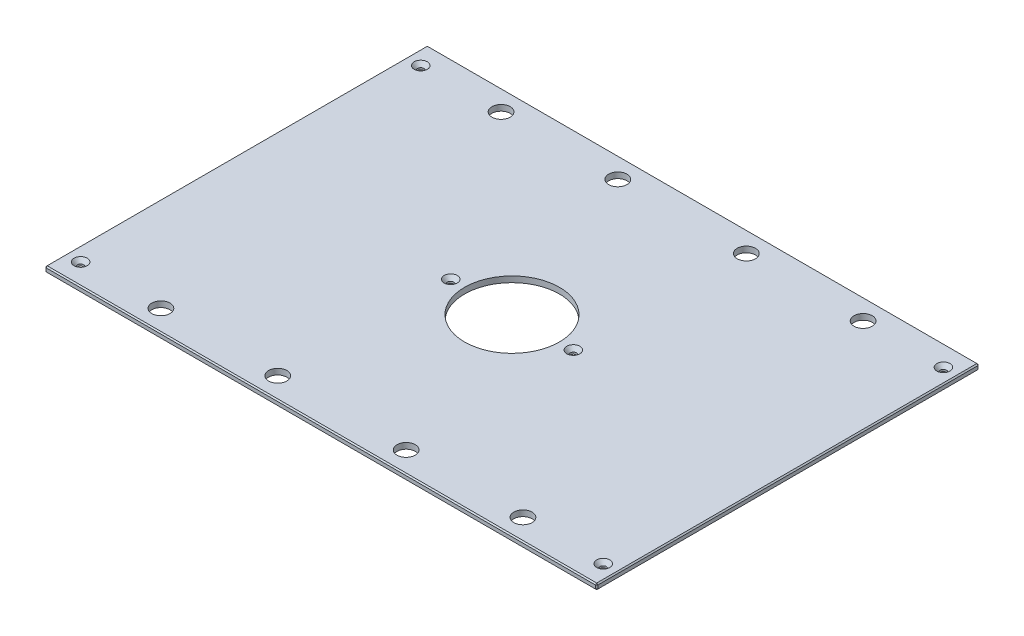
ISO-10303-21;
HEADER;
FILE_DESCRIPTION(('STEP AP214'),'2;1');
FILE_NAME('part.step','',(''),(''),'','','');
FILE_SCHEMA(('AUTOMOTIVE_DESIGN { 1 0 10303 214 1 1 1 1 }'));
ENDSEC;
DATA;
#1=APPLICATION_CONTEXT('core data for automotive mechanical design processes');
#2=APPLICATION_PROTOCOL_DEFINITION('international standard','automotive_design',2000,#1);
#3=PRODUCT_CONTEXT('',#1,'mechanical');
#4=PRODUCT('Part','Part','',(#3));
#5=PRODUCT_RELATED_PRODUCT_CATEGORY('part','',(#4));
#6=PRODUCT_DEFINITION_FORMATION('','',#4);
#7=PRODUCT_DEFINITION_CONTEXT('part definition',#1,'design');
#8=PRODUCT_DEFINITION('design','',#6,#7);
#9=PRODUCT_DEFINITION_SHAPE('','',#8);
#10=(LENGTH_UNIT() NAMED_UNIT(*) SI_UNIT(.MILLI.,.METRE.));
#11=(NAMED_UNIT(*) PLANE_ANGLE_UNIT() SI_UNIT($,.RADIAN.));
#12=(NAMED_UNIT(*) SI_UNIT($,.STERADIAN.) SOLID_ANGLE_UNIT());
#13=UNCERTAINTY_MEASURE_WITH_UNIT(LENGTH_MEASURE(1.E-05),#10,'distance_accuracy_value','');
#14=(GEOMETRIC_REPRESENTATION_CONTEXT(3) GLOBAL_UNCERTAINTY_ASSIGNED_CONTEXT((#13)) GLOBAL_UNIT_ASSIGNED_CONTEXT((#10,
#11,#12)) REPRESENTATION_CONTEXT('',''));
#15=CARTESIAN_POINT('',(0.,0.,0.));
#16=DIRECTION('',(0.,0.,1.));
#17=DIRECTION('',(1.,0.,0.));
#18=AXIS2_PLACEMENT_3D('',#15,#16,#17);
#19=CARTESIAN_POINT('',(-300.0375,6.35,-207.9625));
#20=DIRECTION('',(1.,0.,0.));
#21=DIRECTION('',(0.,0.,-1.));
#22=AXIS2_PLACEMENT_3D('',#19,#20,#21);
#23=PLANE('',#22);
#24=DIRECTION('',(0.,0.,-1.));
#25=VECTOR('',#24,1.);
#26=CARTESIAN_POINT('',(-300.0375,5.08000000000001,-207.9625));
#27=LINE('',#26,#25);
#28=CARTESIAN_POINT('',(-300.0375,5.08000000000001,206.6925));
#29=VERTEX_POINT('',#28);
#30=CARTESIAN_POINT('',(-300.0375,5.08000000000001,-206.6925));
#31=VERTEX_POINT('',#30);
#32=EDGE_CURVE('E142',#29,#31,#27,.T.);
#33=ORIENTED_EDGE('',*,*,#32,.T.);
#34=DIRECTION('',(0.,-1.,0.));
#35=VECTOR('',#34,1.);
#36=CARTESIAN_POINT('',(-300.0375,6.35,-206.6925));
#37=LINE('',#36,#35);
#38=CARTESIAN_POINT('',(-300.0375,1.26999999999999,-206.6925));
#39=VERTEX_POINT('',#38);
#40=EDGE_CURVE('E137',#31,#39,#37,.T.);
#41=ORIENTED_EDGE('',*,*,#40,.T.);
#42=DIRECTION('',(0.,0.,1.));
#43=VECTOR('',#42,1.);
#44=CARTESIAN_POINT('',(-300.0375,1.26999999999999,-207.9625));
#45=LINE('',#44,#43);
#46=CARTESIAN_POINT('',(-300.0375,1.26999999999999,206.6925));
#47=VERTEX_POINT('',#46);
#48=EDGE_CURVE('E132',#39,#47,#45,.T.);
#49=ORIENTED_EDGE('',*,*,#48,.T.);
#50=DIRECTION('',(0.,1.,0.));
#51=VECTOR('',#50,1.);
#52=CARTESIAN_POINT('',(-300.0375,6.35,206.6925));
#53=LINE('',#52,#51);
#54=EDGE_CURVE('E134',#47,#29,#53,.T.);
#55=ORIENTED_EDGE('',*,*,#54,.T.);
#56=EDGE_LOOP('',(#33,#41,#49,#55));
#57=FACE_BOUND('',#56,.T.);
#58=ADVANCED_FACE('F40',(#57),#23,.F.);
#59=CARTESIAN_POINT('',(-300.0375,6.35,207.9625));
#60=DIRECTION('',(0.,0.,-1.));
#61=DIRECTION('',(-1.,0.,0.));
#62=AXIS2_PLACEMENT_3D('',#59,#60,#61);
#63=PLANE('',#62);
#64=DIRECTION('',(1.,0.,0.));
#65=VECTOR('',#64,1.);
#66=CARTESIAN_POINT('',(-300.0375,1.26999999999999,207.9625));
#67=LINE('',#66,#65);
#68=CARTESIAN_POINT('',(-298.7675,1.26999999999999,207.9625));
#69=VERTEX_POINT('',#68);
#70=CARTESIAN_POINT('',(298.7675,1.26999999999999,207.9625));
#71=VERTEX_POINT('',#70);
#72=EDGE_CURVE('E64',#69,#71,#67,.T.);
#73=ORIENTED_EDGE('',*,*,#72,.T.);
#74=DIRECTION('',(0.,1.,0.));
#75=VECTOR('',#74,1.);
#76=CARTESIAN_POINT('',(298.7675,6.35,207.9625));
#77=LINE('',#76,#75);
#78=CARTESIAN_POINT('',(298.7675,5.08000000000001,207.9625));
#79=VERTEX_POINT('',#78);
#80=EDGE_CURVE('E11',#71,#79,#77,.T.);
#81=ORIENTED_EDGE('',*,*,#80,.T.);
#82=DIRECTION('',(-1.,0.,0.));
#83=VECTOR('',#82,1.);
#84=CARTESIAN_POINT('',(-300.0375,5.08000000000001,207.9625));
#85=LINE('',#84,#83);
#86=CARTESIAN_POINT('',(-298.7675,5.08000000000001,207.9625));
#87=VERTEX_POINT('',#86);
#88=EDGE_CURVE('E50',#79,#87,#85,.T.);
#89=ORIENTED_EDGE('',*,*,#88,.T.);
#90=DIRECTION('',(0.,-1.,0.));
#91=VECTOR('',#90,1.);
#92=CARTESIAN_POINT('',(-298.7675,6.35,207.9625));
#93=LINE('',#92,#91);
#94=EDGE_CURVE('E368',#87,#69,#93,.T.);
#95=ORIENTED_EDGE('',*,*,#94,.T.);
#96=EDGE_LOOP('',(#73,#81,#89,#95));
#97=FACE_BOUND('',#96,.T.);
#98=ADVANCED_FACE('F446',(#97),#63,.F.);
#99=CARTESIAN_POINT('',(300.0375,6.35,-207.9625));
#100=DIRECTION('',(-1.,0.,0.));
#101=DIRECTION('',(0.,0.,1.));
#102=AXIS2_PLACEMENT_3D('',#99,#100,#101);
#103=PLANE('',#102);
#104=DIRECTION('',(0.,0.,-1.));
#105=VECTOR('',#104,1.);
#106=CARTESIAN_POINT('',(300.0375,1.26999999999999,-207.9625));
#107=LINE('',#106,#105);
#108=CARTESIAN_POINT('',(300.0375,1.26999999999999,206.6925));
#109=VERTEX_POINT('',#108);
#110=CARTESIAN_POINT('',(300.0375,1.26999999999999,-206.6925));
#111=VERTEX_POINT('',#110);
#112=EDGE_CURVE('E361',#109,#111,#107,.T.);
#113=ORIENTED_EDGE('',*,*,#112,.T.);
#114=DIRECTION('',(0.,1.,0.));
#115=VECTOR('',#114,1.);
#116=CARTESIAN_POINT('',(300.0375,6.35,-206.6925));
#117=LINE('',#116,#115);
#118=CARTESIAN_POINT('',(300.0375,5.08000000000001,-206.6925));
#119=VERTEX_POINT('',#118);
#120=EDGE_CURVE('E364',#111,#119,#117,.T.);
#121=ORIENTED_EDGE('',*,*,#120,.T.);
#122=DIRECTION('',(0.,0.,1.));
#123=VECTOR('',#122,1.);
#124=CARTESIAN_POINT('',(300.0375,5.08000000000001,207.9625));
#125=LINE('',#124,#123);
#126=CARTESIAN_POINT('',(300.0375,5.08000000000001,206.6925));
#127=VERTEX_POINT('',#126);
#128=EDGE_CURVE('E358',#119,#127,#125,.T.);
#129=ORIENTED_EDGE('',*,*,#128,.T.);
#130=DIRECTION('',(0.,-1.,0.));
#131=VECTOR('',#130,1.);
#132=CARTESIAN_POINT('',(300.0375,6.35,206.6925));
#133=LINE('',#132,#131);
#134=EDGE_CURVE('E355',#127,#109,#133,.T.);
#135=ORIENTED_EDGE('',*,*,#134,.T.);
#136=EDGE_LOOP('',(#113,#121,#129,#135));
#137=FACE_BOUND('',#136,.T.);
#138=ADVANCED_FACE('F433',(#137),#103,.F.);
#139=CARTESIAN_POINT('',(-300.0375,6.35,-207.9625));
#140=DIRECTION('',(0.,0.,1.));
#141=DIRECTION('',(1.,0.,0.));
#142=AXIS2_PLACEMENT_3D('',#139,#140,#141);
#143=PLANE('',#142);
#144=DIRECTION('',(-1.,0.,0.));
#145=VECTOR('',#144,1.);
#146=CARTESIAN_POINT('',(-300.0375,1.26999999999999,-207.9625));
#147=LINE('',#146,#145);
#148=CARTESIAN_POINT('',(298.7675,1.26999999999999,-207.9625));
#149=VERTEX_POINT('',#148);
#150=CARTESIAN_POINT('',(-298.7675,1.26999999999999,-207.9625));
#151=VERTEX_POINT('',#150);
#152=EDGE_CURVE('E320',#149,#151,#147,.T.);
#153=ORIENTED_EDGE('',*,*,#152,.T.);
#154=DIRECTION('',(0.,1.,0.));
#155=VECTOR('',#154,1.);
#156=CARTESIAN_POINT('',(-298.7675,6.35,-207.9625));
#157=LINE('',#156,#155);
#158=CARTESIAN_POINT('',(-298.7675,5.08000000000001,-207.9625));
#159=VERTEX_POINT('',#158);
#160=EDGE_CURVE('E326',#151,#159,#157,.T.);
#161=ORIENTED_EDGE('',*,*,#160,.T.);
#162=DIRECTION('',(1.,0.,0.));
#163=VECTOR('',#162,1.);
#164=CARTESIAN_POINT('',(300.0375,5.08000000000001,-207.9625));
#165=LINE('',#164,#163);
#166=CARTESIAN_POINT('',(298.7675,5.08000000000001,-207.9625));
#167=VERTEX_POINT('',#166);
#168=EDGE_CURVE('E323',#159,#167,#165,.T.);
#169=ORIENTED_EDGE('',*,*,#168,.T.);
#170=DIRECTION('',(0.,-1.,0.));
#171=VECTOR('',#170,1.);
#172=CARTESIAN_POINT('',(298.7675,6.35,-207.9625));
#173=LINE('',#172,#171);
#174=EDGE_CURVE('E317',#167,#149,#173,.T.);
#175=ORIENTED_EDGE('',*,*,#174,.T.);
#176=EDGE_LOOP('',(#153,#161,#169,#175));
#177=FACE_BOUND('',#176,.T.);
#178=ADVANCED_FACE('F407',(#177),#143,.F.);
#179=CARTESIAN_POINT('',(0.,6.35,0.));
#180=DIRECTION('',(0.,1.,0.));
#181=DIRECTION('',(0.,0.,1.));
#182=AXIS2_PLACEMENT_3D('',#179,#180,#181);
#183=PLANE('',#182);
#184=CARTESIAN_POINT('',(284.1625,6.35,-184.94248));
#185=DIRECTION('',(0.,1.,0.));
#186=DIRECTION('',(0.,0.,1.));
#187=AXIS2_PLACEMENT_3D('',#184,#185,#186);
#188=CIRCLE('',#187,7.13740000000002);
#189=CARTESIAN_POINT('',(284.1625,6.35,-177.80508));
#190=VERTEX_POINT('',#189);
#191=EDGE_CURVE('E978',#190,#190,#188,.T.);
#192=ORIENTED_EDGE('',*,*,#191,.F.);
#193=EDGE_LOOP('',(#192));
#194=FACE_BOUND('',#193,.T.);
#195=CARTESIAN_POINT('',(284.1625,6.35,184.94248));
#196=DIRECTION('',(0.,1.,0.));
#197=DIRECTION('',(0.,0.,1.));
#198=AXIS2_PLACEMENT_3D('',#195,#196,#197);
#199=CIRCLE('',#198,7.13740000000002);
#200=CARTESIAN_POINT('',(284.1625,6.35,192.07988));
#201=VERTEX_POINT('',#200);
#202=EDGE_CURVE('E982',#201,#201,#199,.T.);
#203=ORIENTED_EDGE('',*,*,#202,.F.);
#204=EDGE_LOOP('',(#203));
#205=FACE_BOUND('',#204,.T.);
#206=CARTESIAN_POINT('',(-284.1625,6.35,184.94248));
#207=DIRECTION('',(0.,1.,0.));
#208=DIRECTION('',(0.,0.,1.));
#209=AXIS2_PLACEMENT_3D('',#206,#207,#208);
#210=CIRCLE('',#209,7.13740000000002);
#211=CARTESIAN_POINT('',(-284.1625,6.35,192.07988));
#212=VERTEX_POINT('',#211);
#213=EDGE_CURVE('E986',#212,#212,#210,.T.);
#214=ORIENTED_EDGE('',*,*,#213,.F.);
#215=EDGE_LOOP('',(#214));
#216=FACE_BOUND('',#215,.T.);
#217=CARTESIAN_POINT('',(-66.675,6.35,0.));
#218=DIRECTION('',(0.,1.,0.));
#219=DIRECTION('',(0.,0.,1.));
#220=AXIS2_PLACEMENT_3D('',#217,#218,#219);
#221=CIRCLE('',#220,7.1374);
#222=CARTESIAN_POINT('',(-66.675,6.35,7.1374));
#223=VERTEX_POINT('',#222);
#224=EDGE_CURVE('E990',#223,#223,#221,.T.);
#225=ORIENTED_EDGE('',*,*,#224,.F.);
#226=EDGE_LOOP('',(#225));
#227=FACE_BOUND('',#226,.T.);
#228=CARTESIAN_POINT('',(66.675,6.35,0.));
#229=DIRECTION('',(0.,1.,0.));
#230=DIRECTION('',(0.,0.,1.));
#231=AXIS2_PLACEMENT_3D('',#228,#229,#230);
#232=CIRCLE('',#231,7.1374);
#233=CARTESIAN_POINT('',(66.675,6.35,7.1374));
#234=VERTEX_POINT('',#233);
#235=EDGE_CURVE('E994',#234,#234,#232,.T.);
#236=ORIENTED_EDGE('',*,*,#235,.F.);
#237=EDGE_LOOP('',(#236));
#238=FACE_BOUND('',#237,.T.);
#239=CARTESIAN_POINT('',(-284.1625,6.35,-184.94248));
#240=DIRECTION('',(0.,1.,0.));
#241=DIRECTION('',(0.,0.,1.));
#242=AXIS2_PLACEMENT_3D('',#239,#240,#241);
#243=CIRCLE('',#242,7.13740000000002);
#244=CARTESIAN_POINT('',(-284.1625,6.35,-177.80508));
#245=VERTEX_POINT('',#244);
#246=EDGE_CURVE('E997',#245,#245,#243,.T.);
#247=ORIENTED_EDGE('',*,*,#246,.F.);
#248=EDGE_LOOP('',(#247));
#249=FACE_BOUND('',#248,.T.);
#250=DIRECTION('',(0.,0.,-1.));
#251=VECTOR('',#250,1.);
#252=CARTESIAN_POINT('',(298.7675,6.35,-207.9625));
#253=LINE('',#252,#251);
#254=CARTESIAN_POINT('',(298.7675,6.35,206.6925));
#255=VERTEX_POINT('',#254);
#256=CARTESIAN_POINT('',(298.7675,6.35,-206.6925));
#257=VERTEX_POINT('',#256);
#258=EDGE_CURVE('E336',#255,#257,#253,.T.);
#259=ORIENTED_EDGE('',*,*,#258,.T.);
#260=DIRECTION('',(-1.,0.,0.));
#261=VECTOR('',#260,1.);
#262=CARTESIAN_POINT('',(-300.0375,6.35,-206.6925));
#263=LINE('',#262,#261);
#264=CARTESIAN_POINT('',(-298.7675,6.35,-206.6925));
#265=VERTEX_POINT('',#264);
#266=EDGE_CURVE('E339',#257,#265,#263,.T.);
#267=ORIENTED_EDGE('',*,*,#266,.T.);
#268=DIRECTION('',(0.,0.,1.));
#269=VECTOR('',#268,1.);
#270=CARTESIAN_POINT('',(-298.7675,6.35,207.9625));
#271=LINE('',#270,#269);
#272=CARTESIAN_POINT('',(-298.7675,6.35,206.6925));
#273=VERTEX_POINT('',#272);
#274=EDGE_CURVE('E333',#265,#273,#271,.T.);
#275=ORIENTED_EDGE('',*,*,#274,.T.);
#276=DIRECTION('',(1.,0.,0.));
#277=VECTOR('',#276,1.);
#278=CARTESIAN_POINT('',(300.0375,6.35,206.6925));
#279=LINE('',#278,#277);
#280=EDGE_CURVE('E330',#273,#255,#279,.T.);
#281=ORIENTED_EDGE('',*,*,#280,.T.);
#282=EDGE_LOOP('',(#259,#267,#275,#281));
#283=FACE_BOUND('',#282,.T.);
#284=CARTESIAN_POINT('',(196.85,6.35,-184.94248));
#285=DIRECTION('',(0.,1.,0.));
#286=DIRECTION('',(0.,0.,1.));
#287=AXIS2_PLACEMENT_3D('',#284,#285,#286);
#288=CIRCLE('',#287,9.921875);
#289=CARTESIAN_POINT('',(196.85,6.35,-175.020605));
#290=VERTEX_POINT('',#289);
#291=EDGE_CURVE('E232',#290,#290,#288,.T.);
#292=ORIENTED_EDGE('',*,*,#291,.F.);
#293=EDGE_LOOP('',(#292));
#294=FACE_BOUND('',#293,.T.);
#295=CARTESIAN_POINT('',(-196.85,6.35,-184.94248));
#296=DIRECTION('',(0.,1.,0.));
#297=DIRECTION('',(0.,0.,1.));
#298=AXIS2_PLACEMENT_3D('',#295,#296,#297);
#299=CIRCLE('',#298,9.921875);
#300=CARTESIAN_POINT('',(-196.85,6.35,-175.020605));
#301=VERTEX_POINT('',#300);
#302=EDGE_CURVE('E247',#301,#301,#299,.T.);
#303=ORIENTED_EDGE('',*,*,#302,.F.);
#304=EDGE_LOOP('',(#303));
#305=FACE_BOUND('',#304,.T.);
#306=CARTESIAN_POINT('',(196.85,6.35,184.94248));
#307=DIRECTION('',(0.,1.,0.));
#308=DIRECTION('',(0.,0.,1.));
#309=AXIS2_PLACEMENT_3D('',#306,#307,#308);
#310=CIRCLE('',#309,9.921875);
#311=CARTESIAN_POINT('',(196.85,6.35,194.864355));
#312=VERTEX_POINT('',#311);
#313=EDGE_CURVE('E259',#312,#312,#310,.T.);
#314=ORIENTED_EDGE('',*,*,#313,.F.);
#315=EDGE_LOOP('',(#314));
#316=FACE_BOUND('',#315,.T.);
#317=CARTESIAN_POINT('',(-196.85,6.35,184.94248));
#318=DIRECTION('',(0.,1.,0.));
#319=DIRECTION('',(0.,0.,1.));
#320=AXIS2_PLACEMENT_3D('',#317,#318,#319);
#321=CIRCLE('',#320,9.921875);
#322=CARTESIAN_POINT('',(-196.85,6.35,194.864355));
#323=VERTEX_POINT('',#322);
#324=EDGE_CURVE('E266',#323,#323,#321,.T.);
#325=ORIENTED_EDGE('',*,*,#324,.F.);
#326=EDGE_LOOP('',(#325));
#327=FACE_BOUND('',#326,.T.);
#328=CARTESIAN_POINT('',(-69.85,6.35,-184.94248));
#329=DIRECTION('',(0.,1.,0.));
#330=DIRECTION('',(0.,0.,1.));
#331=AXIS2_PLACEMENT_3D('',#328,#329,#330);
#332=CIRCLE('',#331,9.921875);
#333=CARTESIAN_POINT('',(-69.85,6.35,-175.020605));
#334=VERTEX_POINT('',#333);
#335=EDGE_CURVE('E274',#334,#334,#332,.T.);
#336=ORIENTED_EDGE('',*,*,#335,.F.);
#337=EDGE_LOOP('',(#336));
#338=FACE_BOUND('',#337,.T.);
#339=CARTESIAN_POINT('',(69.85,6.35,-184.94248));
#340=DIRECTION('',(0.,1.,0.));
#341=DIRECTION('',(0.,0.,1.));
#342=AXIS2_PLACEMENT_3D('',#339,#340,#341);
#343=CIRCLE('',#342,9.921875);
#344=CARTESIAN_POINT('',(69.85,6.35,-175.020605));
#345=VERTEX_POINT('',#344);
#346=EDGE_CURVE('E282',#345,#345,#343,.T.);
#347=ORIENTED_EDGE('',*,*,#346,.F.);
#348=EDGE_LOOP('',(#347));
#349=FACE_BOUND('',#348,.T.);
#350=CARTESIAN_POINT('',(69.85,6.35,184.94248));
#351=DIRECTION('',(0.,1.,0.));
#352=DIRECTION('',(0.,0.,1.));
#353=AXIS2_PLACEMENT_3D('',#350,#351,#352);
#354=CIRCLE('',#353,9.921875);
#355=CARTESIAN_POINT('',(69.85,6.35,194.864355));
#356=VERTEX_POINT('',#355);
#357=EDGE_CURVE('E290',#356,#356,#354,.T.);
#358=ORIENTED_EDGE('',*,*,#357,.F.);
#359=EDGE_LOOP('',(#358));
#360=FACE_BOUND('',#359,.T.);
#361=CARTESIAN_POINT('',(-69.85,6.35,184.94248));
#362=DIRECTION('',(0.,1.,0.));
#363=DIRECTION('',(0.,0.,1.));
#364=AXIS2_PLACEMENT_3D('',#361,#362,#363);
#365=CIRCLE('',#364,9.921875);
#366=CARTESIAN_POINT('',(-69.85,6.35,194.864355));
#367=VERTEX_POINT('',#366);
#368=EDGE_CURVE('E298',#367,#367,#365,.T.);
#369=ORIENTED_EDGE('',*,*,#368,.F.);
#370=EDGE_LOOP('',(#369));
#371=FACE_BOUND('',#370,.T.);
#372=CARTESIAN_POINT('',(0.,6.35,0.));
#373=DIRECTION('',(0.,1.,0.));
#374=DIRECTION('',(0.,0.,1.));
#375=AXIS2_PLACEMENT_3D('',#372,#373,#374);
#376=CIRCLE('',#375,51.562);
#377=CARTESIAN_POINT('',(0.,6.35,51.562));
#378=VERTEX_POINT('',#377);
#379=EDGE_CURVE('E306',#378,#378,#376,.T.);
#380=ORIENTED_EDGE('',*,*,#379,.F.);
#381=EDGE_LOOP('',(#380));
#382=FACE_BOUND('',#381,.T.);
#383=ADVANCED_FACE('F455',(#194,#205,#216,#227,#238,#249,#283,#294,#305,#316,#327,#338,#349,
#360,#371,#382),#183,.T.);
#384=CARTESIAN_POINT('',(0.,0.,0.));
#385=DIRECTION('',(0.,1.,0.));
#386=DIRECTION('',(0.,0.,1.));
#387=AXIS2_PLACEMENT_3D('',#384,#385,#386);
#388=PLANE('',#387);
#389=CARTESIAN_POINT('',(284.1625,0.,-184.94248));
#390=DIRECTION('',(0.,1.,0.));
#391=DIRECTION('',(0.,0.,1.));
#392=AXIS2_PLACEMENT_3D('',#389,#390,#391);
#393=CIRCLE('',#392,3.3782);
#394=CARTESIAN_POINT('',(284.1625,0.,-181.56428));
#395=VERTEX_POINT('',#394);
#396=EDGE_CURVE('E1043',#395,#395,#393,.T.);
#397=ORIENTED_EDGE('',*,*,#396,.T.);
#398=EDGE_LOOP('',(#397));
#399=FACE_BOUND('',#398,.T.);
#400=CARTESIAN_POINT('',(284.1625,0.,184.94248));
#401=DIRECTION('',(0.,1.,0.));
#402=DIRECTION('',(0.,0.,1.));
#403=AXIS2_PLACEMENT_3D('',#400,#401,#402);
#404=CIRCLE('',#403,3.3782);
#405=CARTESIAN_POINT('',(284.1625,0.,188.32068));
#406=VERTEX_POINT('',#405);
#407=EDGE_CURVE('E1033',#406,#406,#404,.T.);
#408=ORIENTED_EDGE('',*,*,#407,.T.);
#409=EDGE_LOOP('',(#408));
#410=FACE_BOUND('',#409,.T.);
#411=CARTESIAN_POINT('',(-284.1625,0.,184.94248));
#412=DIRECTION('',(0.,1.,0.));
#413=DIRECTION('',(0.,0.,1.));
#414=AXIS2_PLACEMENT_3D('',#411,#412,#413);
#415=CIRCLE('',#414,3.3782);
#416=CARTESIAN_POINT('',(-284.1625,0.,188.32068));
#417=VERTEX_POINT('',#416);
#418=EDGE_CURVE('E1025',#417,#417,#415,.T.);
#419=ORIENTED_EDGE('',*,*,#418,.T.);
#420=EDGE_LOOP('',(#419));
#421=FACE_BOUND('',#420,.T.);
#422=CARTESIAN_POINT('',(-66.675,0.,0.));
#423=DIRECTION('',(0.,1.,0.));
#424=DIRECTION('',(0.,0.,1.));
#425=AXIS2_PLACEMENT_3D('',#422,#423,#424);
#426=CIRCLE('',#425,3.3782);
#427=CARTESIAN_POINT('',(-66.675,0.,3.3782));
#428=VERTEX_POINT('',#427);
#429=EDGE_CURVE('E1015',#428,#428,#426,.T.);
#430=ORIENTED_EDGE('',*,*,#429,.T.);
#431=EDGE_LOOP('',(#430));
#432=FACE_BOUND('',#431,.T.);
#433=CARTESIAN_POINT('',(66.675,0.,0.));
#434=DIRECTION('',(0.,1.,0.));
#435=DIRECTION('',(0.,0.,1.));
#436=AXIS2_PLACEMENT_3D('',#433,#434,#435);
#437=CIRCLE('',#436,3.3782);
#438=CARTESIAN_POINT('',(66.675,0.,3.3782));
#439=VERTEX_POINT('',#438);
#440=EDGE_CURVE('E1001',#439,#439,#437,.T.);
#441=ORIENTED_EDGE('',*,*,#440,.T.);
#442=EDGE_LOOP('',(#441));
#443=FACE_BOUND('',#442,.T.);
#444=CARTESIAN_POINT('',(-284.1625,0.,-184.94248));
#445=DIRECTION('',(0.,1.,0.));
#446=DIRECTION('',(0.,0.,1.));
#447=AXIS2_PLACEMENT_3D('',#444,#445,#446);
#448=CIRCLE('',#447,3.3782);
#449=CARTESIAN_POINT('',(-284.1625,0.,-181.56428));
#450=VERTEX_POINT('',#449);
#451=EDGE_CURVE('E250',#450,#450,#448,.T.);
#452=ORIENTED_EDGE('',*,*,#451,.T.);
#453=EDGE_LOOP('',(#452));
#454=FACE_BOUND('',#453,.T.);
#455=DIRECTION('',(0.,0.,-1.));
#456=VECTOR('',#455,1.);
#457=CARTESIAN_POINT('',(-298.7675,0.,0.));
#458=LINE('',#457,#456);
#459=CARTESIAN_POINT('',(-298.7675,0.,206.6925));
#460=VERTEX_POINT('',#459);
#461=CARTESIAN_POINT('',(-298.7675,0.,-206.6925));
#462=VERTEX_POINT('',#461);
#463=EDGE_CURVE('E167',#460,#462,#458,.T.);
#464=ORIENTED_EDGE('',*,*,#463,.T.);
#465=DIRECTION('',(1.,0.,0.));
#466=VECTOR('',#465,1.);
#467=CARTESIAN_POINT('',(0.,0.,-206.6925));
#468=LINE('',#467,#466);
#469=CARTESIAN_POINT('',(298.7675,0.,-206.6925));
#470=VERTEX_POINT('',#469);
#471=EDGE_CURVE('E351',#462,#470,#468,.T.);
#472=ORIENTED_EDGE('',*,*,#471,.T.);
#473=DIRECTION('',(0.,0.,1.));
#474=VECTOR('',#473,1.);
#475=CARTESIAN_POINT('',(298.7675,0.,0.));
#476=LINE('',#475,#474);
#477=CARTESIAN_POINT('',(298.7675,0.,206.6925));
#478=VERTEX_POINT('',#477);
#479=EDGE_CURVE('E348',#470,#478,#476,.T.);
#480=ORIENTED_EDGE('',*,*,#479,.T.);
#481=DIRECTION('',(-1.,0.,0.));
#482=VECTOR('',#481,1.);
#483=CARTESIAN_POINT('',(0.,0.,206.6925));
#484=LINE('',#483,#482);
#485=EDGE_CURVE('E343',#478,#460,#484,.T.);
#486=ORIENTED_EDGE('',*,*,#485,.T.);
#487=EDGE_LOOP('',(#464,#472,#480,#486));
#488=FACE_BOUND('',#487,.T.);
#489=CARTESIAN_POINT('',(196.85,0.,-184.94248));
#490=DIRECTION('',(0.,1.,0.));
#491=DIRECTION('',(0.,0.,1.));
#492=AXIS2_PLACEMENT_3D('',#489,#490,#491);
#493=CIRCLE('',#492,9.921875);
#494=CARTESIAN_POINT('',(196.85,0.,-175.020605));
#495=VERTEX_POINT('',#494);
#496=EDGE_CURVE('E240',#495,#495,#493,.T.);
#497=ORIENTED_EDGE('',*,*,#496,.T.);
#498=EDGE_LOOP('',(#497));
#499=FACE_BOUND('',#498,.T.);
#500=CARTESIAN_POINT('',(-196.85,0.,-184.94248));
#501=DIRECTION('',(0.,1.,0.));
#502=DIRECTION('',(0.,0.,1.));
#503=AXIS2_PLACEMENT_3D('',#500,#501,#502);
#504=CIRCLE('',#503,9.921875);
#505=CARTESIAN_POINT('',(-196.85,0.,-175.020605));
#506=VERTEX_POINT('',#505);
#507=EDGE_CURVE('E255',#506,#506,#504,.T.);
#508=ORIENTED_EDGE('',*,*,#507,.T.);
#509=EDGE_LOOP('',(#508));
#510=FACE_BOUND('',#509,.T.);
#511=CARTESIAN_POINT('',(196.85,0.,184.94248));
#512=DIRECTION('',(0.,1.,0.));
#513=DIRECTION('',(0.,0.,1.));
#514=AXIS2_PLACEMENT_3D('',#511,#512,#513);
#515=CIRCLE('',#514,9.921875);
#516=CARTESIAN_POINT('',(196.85,0.,194.864355));
#517=VERTEX_POINT('',#516);
#518=EDGE_CURVE('E263',#517,#517,#515,.T.);
#519=ORIENTED_EDGE('',*,*,#518,.T.);
#520=EDGE_LOOP('',(#519));
#521=FACE_BOUND('',#520,.T.);
#522=CARTESIAN_POINT('',(-196.85,0.,184.94248));
#523=DIRECTION('',(0.,1.,0.));
#524=DIRECTION('',(0.,0.,1.));
#525=AXIS2_PLACEMENT_3D('',#522,#523,#524);
#526=CIRCLE('',#525,9.921875);
#527=CARTESIAN_POINT('',(-196.85,0.,194.864355));
#528=VERTEX_POINT('',#527);
#529=EDGE_CURVE('E270',#528,#528,#526,.T.);
#530=ORIENTED_EDGE('',*,*,#529,.T.);
#531=EDGE_LOOP('',(#530));
#532=FACE_BOUND('',#531,.T.);
#533=CARTESIAN_POINT('',(-69.85,0.,-184.94248));
#534=DIRECTION('',(0.,1.,0.));
#535=DIRECTION('',(0.,0.,1.));
#536=AXIS2_PLACEMENT_3D('',#533,#534,#535);
#537=CIRCLE('',#536,9.921875);
#538=CARTESIAN_POINT('',(-69.85,0.,-175.020605));
#539=VERTEX_POINT('',#538);
#540=EDGE_CURVE('E278',#539,#539,#537,.T.);
#541=ORIENTED_EDGE('',*,*,#540,.T.);
#542=EDGE_LOOP('',(#541));
#543=FACE_BOUND('',#542,.T.);
#544=CARTESIAN_POINT('',(69.85,0.,-184.94248));
#545=DIRECTION('',(0.,1.,0.));
#546=DIRECTION('',(0.,0.,1.));
#547=AXIS2_PLACEMENT_3D('',#544,#545,#546);
#548=CIRCLE('',#547,9.921875);
#549=CARTESIAN_POINT('',(69.85,0.,-175.020605));
#550=VERTEX_POINT('',#549);
#551=EDGE_CURVE('E286',#550,#550,#548,.T.);
#552=ORIENTED_EDGE('',*,*,#551,.T.);
#553=EDGE_LOOP('',(#552));
#554=FACE_BOUND('',#553,.T.);
#555=CARTESIAN_POINT('',(69.85,0.,184.94248));
#556=DIRECTION('',(0.,1.,0.));
#557=DIRECTION('',(0.,0.,1.));
#558=AXIS2_PLACEMENT_3D('',#555,#556,#557);
#559=CIRCLE('',#558,9.921875);
#560=CARTESIAN_POINT('',(69.85,0.,194.864355));
#561=VERTEX_POINT('',#560);
#562=EDGE_CURVE('E294',#561,#561,#559,.T.);
#563=ORIENTED_EDGE('',*,*,#562,.T.);
#564=EDGE_LOOP('',(#563));
#565=FACE_BOUND('',#564,.T.);
#566=CARTESIAN_POINT('',(-69.85,0.,184.94248));
#567=DIRECTION('',(0.,1.,0.));
#568=DIRECTION('',(0.,0.,1.));
#569=AXIS2_PLACEMENT_3D('',#566,#567,#568);
#570=CIRCLE('',#569,9.921875);
#571=CARTESIAN_POINT('',(-69.85,0.,194.864355));
#572=VERTEX_POINT('',#571);
#573=EDGE_CURVE('E302',#572,#572,#570,.T.);
#574=ORIENTED_EDGE('',*,*,#573,.T.);
#575=EDGE_LOOP('',(#574));
#576=FACE_BOUND('',#575,.T.);
#577=CARTESIAN_POINT('',(0.,0.,0.));
#578=DIRECTION('',(0.,1.,0.));
#579=DIRECTION('',(0.,0.,1.));
#580=AXIS2_PLACEMENT_3D('',#577,#578,#579);
#581=CIRCLE('',#580,51.562);
#582=CARTESIAN_POINT('',(0.,0.,51.562));
#583=VERTEX_POINT('',#582);
#584=EDGE_CURVE('E155',#583,#583,#581,.T.);
#585=ORIENTED_EDGE('',*,*,#584,.T.);
#586=EDGE_LOOP('',(#585));
#587=FACE_BOUND('',#586,.T.);
#588=ADVANCED_FACE('F420',(#399,#410,#421,#432,#443,#454,#488,#499,#510,#521,#532,#543,#554,
#565,#576,#587),#388,.F.);
#589=CARTESIAN_POINT('',(0.,0.,0.));
#590=DIRECTION('',(0.,1.,0.));
#591=DIRECTION('',(0.,0.,1.));
#592=AXIS2_PLACEMENT_3D('',#589,#590,#591);
#593=CYLINDRICAL_SURFACE('',#592,51.562);
#594=ORIENTED_EDGE('',*,*,#584,.F.);
#595=EDGE_LOOP('',(#594));
#596=FACE_BOUND('',#595,.T.);
#597=ORIENTED_EDGE('',*,*,#379,.T.);
#598=EDGE_LOOP('',(#597));
#599=FACE_BOUND('',#598,.T.);
#600=ADVANCED_FACE('F701',(#596,#599),#593,.F.);
#601=CARTESIAN_POINT('',(-69.85,6.35,184.94248));
#602=DIRECTION('',(0.,1.,0.));
#603=DIRECTION('',(0.,0.,1.));
#604=AXIS2_PLACEMENT_3D('',#601,#602,#603);
#605=CYLINDRICAL_SURFACE('',#604,9.921875);
#606=ORIENTED_EDGE('',*,*,#573,.F.);
#607=EDGE_LOOP('',(#606));
#608=FACE_BOUND('',#607,.T.);
#609=ORIENTED_EDGE('',*,*,#368,.T.);
#610=EDGE_LOOP('',(#609));
#611=FACE_BOUND('',#610,.T.);
#612=ADVANCED_FACE('F895',(#608,#611),#605,.F.);
#613=CARTESIAN_POINT('',(69.85,6.35,184.94248));
#614=DIRECTION('',(0.,1.,0.));
#615=DIRECTION('',(0.,0.,1.));
#616=AXIS2_PLACEMENT_3D('',#613,#614,#615);
#617=CYLINDRICAL_SURFACE('',#616,9.921875);
#618=ORIENTED_EDGE('',*,*,#562,.F.);
#619=EDGE_LOOP('',(#618));
#620=FACE_BOUND('',#619,.T.);
#621=ORIENTED_EDGE('',*,*,#357,.T.);
#622=EDGE_LOOP('',(#621));
#623=FACE_BOUND('',#622,.T.);
#624=ADVANCED_FACE('F885',(#620,#623),#617,.F.);
#625=CARTESIAN_POINT('',(69.85,6.35,-184.94248));
#626=DIRECTION('',(0.,1.,0.));
#627=DIRECTION('',(0.,0.,1.));
#628=AXIS2_PLACEMENT_3D('',#625,#626,#627);
#629=CYLINDRICAL_SURFACE('',#628,9.921875);
#630=ORIENTED_EDGE('',*,*,#551,.F.);
#631=EDGE_LOOP('',(#630));
#632=FACE_BOUND('',#631,.T.);
#633=ORIENTED_EDGE('',*,*,#346,.T.);
#634=EDGE_LOOP('',(#633));
#635=FACE_BOUND('',#634,.T.);
#636=ADVANCED_FACE('F875',(#632,#635),#629,.F.);
#637=CARTESIAN_POINT('',(-69.85,6.35,-184.94248));
#638=DIRECTION('',(0.,1.,0.));
#639=DIRECTION('',(0.,0.,1.));
#640=AXIS2_PLACEMENT_3D('',#637,#638,#639);
#641=CYLINDRICAL_SURFACE('',#640,9.921875);
#642=ORIENTED_EDGE('',*,*,#540,.F.);
#643=EDGE_LOOP('',(#642));
#644=FACE_BOUND('',#643,.T.);
#645=ORIENTED_EDGE('',*,*,#335,.T.);
#646=EDGE_LOOP('',(#645));
#647=FACE_BOUND('',#646,.T.);
#648=ADVANCED_FACE('F865',(#644,#647),#641,.F.);
#649=CARTESIAN_POINT('',(-196.85,6.35,184.94248));
#650=DIRECTION('',(0.,1.,0.));
#651=DIRECTION('',(0.,0.,1.));
#652=AXIS2_PLACEMENT_3D('',#649,#650,#651);
#653=CYLINDRICAL_SURFACE('',#652,9.921875);
#654=ORIENTED_EDGE('',*,*,#529,.F.);
#655=EDGE_LOOP('',(#654));
#656=FACE_BOUND('',#655,.T.);
#657=ORIENTED_EDGE('',*,*,#324,.T.);
#658=EDGE_LOOP('',(#657));
#659=FACE_BOUND('',#658,.T.);
#660=ADVANCED_FACE('F855',(#656,#659),#653,.F.);
#661=CARTESIAN_POINT('',(196.85,6.35,184.94248));
#662=DIRECTION('',(0.,1.,0.));
#663=DIRECTION('',(0.,0.,1.));
#664=AXIS2_PLACEMENT_3D('',#661,#662,#663);
#665=CYLINDRICAL_SURFACE('',#664,9.921875);
#666=ORIENTED_EDGE('',*,*,#518,.F.);
#667=EDGE_LOOP('',(#666));
#668=FACE_BOUND('',#667,.T.);
#669=ORIENTED_EDGE('',*,*,#313,.T.);
#670=EDGE_LOOP('',(#669));
#671=FACE_BOUND('',#670,.T.);
#672=ADVANCED_FACE('F845',(#668,#671),#665,.F.);
#673=CARTESIAN_POINT('',(-196.85,6.35,-184.94248));
#674=DIRECTION('',(0.,1.,0.));
#675=DIRECTION('',(0.,0.,1.));
#676=AXIS2_PLACEMENT_3D('',#673,#674,#675);
#677=CYLINDRICAL_SURFACE('',#676,9.921875);
#678=ORIENTED_EDGE('',*,*,#507,.F.);
#679=EDGE_LOOP('',(#678));
#680=FACE_BOUND('',#679,.T.);
#681=ORIENTED_EDGE('',*,*,#302,.T.);
#682=EDGE_LOOP('',(#681));
#683=FACE_BOUND('',#682,.T.);
#684=ADVANCED_FACE('F835',(#680,#683),#677,.F.);
#685=CARTESIAN_POINT('',(196.85,6.35,-184.94248));
#686=DIRECTION('',(0.,1.,0.));
#687=DIRECTION('',(0.,0.,1.));
#688=AXIS2_PLACEMENT_3D('',#685,#686,#687);
#689=CYLINDRICAL_SURFACE('',#688,9.921875);
#690=ORIENTED_EDGE('',*,*,#496,.F.);
#691=EDGE_LOOP('',(#690));
#692=FACE_BOUND('',#691,.T.);
#693=ORIENTED_EDGE('',*,*,#291,.T.);
#694=EDGE_LOOP('',(#693));
#695=FACE_BOUND('',#694,.T.);
#696=ADVANCED_FACE('F464',(#692,#695),#689,.F.);
#697=CARTESIAN_POINT('',(300.0375,6.35,206.6925));
#698=DIRECTION('',(-0.707106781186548,0.,-0.707106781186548));
#699=DIRECTION('',(0.,-1.,0.));
#700=AXIS2_PLACEMENT_3D('',#697,#698,#699);
#701=PLANE('',#700);
#702=DIRECTION('',(-0.707106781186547,0.,0.707106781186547));
#703=VECTOR('',#702,1.);
#704=CARTESIAN_POINT('',(300.0375,5.08000000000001,206.6925));
#705=LINE('',#704,#703);
#706=EDGE_CURVE('E44',#79,#127,#705,.F.);
#707=ORIENTED_EDGE('',*,*,#706,.F.);
#708=ORIENTED_EDGE('',*,*,#80,.F.);
#709=DIRECTION('',(0.707106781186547,0.,-0.707106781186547));
#710=VECTOR('',#709,1.);
#711=CARTESIAN_POINT('',(299.4025,1.26999999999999,207.3275));
#712=LINE('',#711,#710);
#713=EDGE_CURVE('E223',#109,#71,#712,.F.);
#714=ORIENTED_EDGE('',*,*,#713,.F.);
#715=ORIENTED_EDGE('',*,*,#134,.F.);
#716=EDGE_LOOP('',(#707,#708,#714,#715));
#717=FACE_BOUND('',#716,.T.);
#718=ADVANCED_FACE('F42',(#717),#701,.F.);
#719=CARTESIAN_POINT('',(300.0375,5.08000000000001,206.6925));
#720=DIRECTION('',(0.577350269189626,0.577350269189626,0.577350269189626));
#721=DIRECTION('',(0.707106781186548,0.,-0.707106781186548));
#722=AXIS2_PLACEMENT_3D('',#719,#720,#721);
#723=PLANE('',#722);
#724=DIRECTION('',(0.,-0.707106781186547,0.707106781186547));
#725=VECTOR('',#724,1.);
#726=CARTESIAN_POINT('',(298.7675,5.715,207.3275));
#727=LINE('',#726,#725);
#728=EDGE_CURVE('E217',#79,#255,#727,.F.);
#729=ORIENTED_EDGE('',*,*,#728,.F.);
#730=ORIENTED_EDGE('',*,*,#706,.T.);
#731=DIRECTION('',(-0.707106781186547,0.707106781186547,0.));
#732=VECTOR('',#731,1.);
#733=CARTESIAN_POINT('',(300.0375,5.08000000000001,206.6925));
#734=LINE('',#733,#732);
#735=EDGE_CURVE('E220',#255,#127,#734,.F.);
#736=ORIENTED_EDGE('',*,*,#735,.F.);
#737=EDGE_LOOP('',(#729,#730,#736));
#738=FACE_BOUND('',#737,.T.);
#739=ADVANCED_FACE('F457',(#738),#723,.T.);
#740=CARTESIAN_POINT('',(298.7675,0.,206.6925));
#741=DIRECTION('',(0.577350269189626,-0.577350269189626,0.577350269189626));
#742=DIRECTION('',(0.707106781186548,0.,-0.707106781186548));
#743=AXIS2_PLACEMENT_3D('',#740,#741,#742);
#744=PLANE('',#743);
#745=DIRECTION('',(-0.707106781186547,-0.707106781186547,0.));
#746=VECTOR('',#745,1.);
#747=CARTESIAN_POINT('',(298.7675,0.,206.6925));
#748=LINE('',#747,#746);
#749=EDGE_CURVE('E209',#109,#478,#748,.T.);
#750=ORIENTED_EDGE('',*,*,#749,.F.);
#751=ORIENTED_EDGE('',*,*,#713,.T.);
#752=DIRECTION('',(0.,0.707106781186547,0.707106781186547));
#753=VECTOR('',#752,1.);
#754=CARTESIAN_POINT('',(298.7675,0.,206.6925));
#755=LINE('',#754,#753);
#756=EDGE_CURVE('E213',#478,#71,#755,.T.);
#757=ORIENTED_EDGE('',*,*,#756,.F.);
#758=EDGE_LOOP('',(#750,#751,#757));
#759=FACE_BOUND('',#758,.T.);
#760=ADVANCED_FACE('F426',(#759),#744,.T.);
#761=CARTESIAN_POINT('',(298.7675,6.35,0.));
#762=DIRECTION('',(0.707106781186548,0.707106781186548,0.));
#763=DIRECTION('',(0.,0.,1.));
#764=AXIS2_PLACEMENT_3D('',#761,#762,#763);
#765=PLANE('',#764);
#766=ORIENTED_EDGE('',*,*,#735,.T.);
#767=ORIENTED_EDGE('',*,*,#128,.F.);
#768=DIRECTION('',(0.707106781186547,-0.707106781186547,0.));
#769=VECTOR('',#768,1.);
#770=CARTESIAN_POINT('',(299.4025,5.715,-206.6925));
#771=LINE('',#770,#769);
#772=EDGE_CURVE('E202',#257,#119,#771,.T.);
#773=ORIENTED_EDGE('',*,*,#772,.F.);
#774=ORIENTED_EDGE('',*,*,#258,.F.);
#775=EDGE_LOOP('',(#766,#767,#773,#774));
#776=FACE_BOUND('',#775,.T.);
#777=ADVANCED_FACE('F443',(#776),#765,.T.);
#778=CARTESIAN_POINT('',(0.,6.35,206.6925));
#779=DIRECTION('',(0.,0.707106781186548,0.707106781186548));
#780=DIRECTION('',(-1.,0.,0.));
#781=AXIS2_PLACEMENT_3D('',#778,#779,#780);
#782=PLANE('',#781);
#783=ORIENTED_EDGE('',*,*,#728,.T.);
#784=ORIENTED_EDGE('',*,*,#280,.F.);
#785=DIRECTION('',(0.,0.707106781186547,-0.707106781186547));
#786=VECTOR('',#785,1.);
#787=CARTESIAN_POINT('',(-298.7675,6.35,206.6925));
#788=LINE('',#787,#786);
#789=EDGE_CURVE('E198',#87,#273,#788,.T.);
#790=ORIENTED_EDGE('',*,*,#789,.F.);
#791=ORIENTED_EDGE('',*,*,#88,.F.);
#792=EDGE_LOOP('',(#783,#784,#790,#791));
#793=FACE_BOUND('',#792,.T.);
#794=ADVANCED_FACE('F448',(#793),#782,.T.);
#795=CARTESIAN_POINT('',(-298.7675,6.35,207.9625));
#796=DIRECTION('',(0.707106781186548,0.,-0.707106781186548));
#797=DIRECTION('',(0.,-1.,0.));
#798=AXIS2_PLACEMENT_3D('',#795,#796,#797);
#799=PLANE('',#798);
#800=DIRECTION('',(0.707106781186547,0.,0.707106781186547));
#801=VECTOR('',#800,1.);
#802=CARTESIAN_POINT('',(-300.0375,1.26999999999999,206.6925));
#803=LINE('',#802,#801);
#804=EDGE_CURVE('E149',#69,#47,#803,.F.);
#805=ORIENTED_EDGE('',*,*,#804,.F.);
#806=ORIENTED_EDGE('',*,*,#94,.F.);
#807=DIRECTION('',(-0.707106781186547,0.,-0.707106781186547));
#808=VECTOR('',#807,1.);
#809=CARTESIAN_POINT('',(-299.4025,5.08000000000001,207.3275));
#810=LINE('',#809,#808);
#811=EDGE_CURVE('E152',#29,#87,#810,.F.);
#812=ORIENTED_EDGE('',*,*,#811,.F.);
#813=ORIENTED_EDGE('',*,*,#54,.F.);
#814=EDGE_LOOP('',(#805,#806,#812,#813));
#815=FACE_BOUND('',#814,.T.);
#816=ADVANCED_FACE('F147',(#815),#799,.F.);
#817=CARTESIAN_POINT('',(-300.0375,1.26999999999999,207.9625));
#818=DIRECTION('',(0.,0.707106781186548,-0.707106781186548));
#819=DIRECTION('',(1.,0.,0.));
#820=AXIS2_PLACEMENT_3D('',#817,#818,#819);
#821=PLANE('',#820);
#822=ORIENTED_EDGE('',*,*,#756,.T.);
#823=ORIENTED_EDGE('',*,*,#72,.F.);
#824=DIRECTION('',(0.,-0.707106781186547,-0.707106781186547));
#825=VECTOR('',#824,1.);
#826=CARTESIAN_POINT('',(-298.7675,0.634999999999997,207.3275));
#827=LINE('',#826,#825);
#828=EDGE_CURVE('E163',#460,#69,#827,.F.);
#829=ORIENTED_EDGE('',*,*,#828,.F.);
#830=ORIENTED_EDGE('',*,*,#485,.F.);
#831=EDGE_LOOP('',(#822,#823,#829,#830));
#832=FACE_BOUND('',#831,.T.);
#833=ADVANCED_FACE('F425',(#832),#821,.F.);
#834=CARTESIAN_POINT('',(300.0375,1.26999999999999,-207.9625));
#835=DIRECTION('',(-0.707106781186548,0.707106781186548,0.));
#836=DIRECTION('',(0.,0.,-1.));
#837=AXIS2_PLACEMENT_3D('',#834,#835,#836);
#838=PLANE('',#837);
#839=ORIENTED_EDGE('',*,*,#749,.T.);
#840=ORIENTED_EDGE('',*,*,#479,.F.);
#841=DIRECTION('',(0.707106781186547,0.707106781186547,0.));
#842=VECTOR('',#841,1.);
#843=CARTESIAN_POINT('',(298.7675,0.,-206.6925));
#844=LINE('',#843,#842);
#845=EDGE_CURVE('E190',#111,#470,#844,.F.);
#846=ORIENTED_EDGE('',*,*,#845,.F.);
#847=ORIENTED_EDGE('',*,*,#112,.F.);
#848=EDGE_LOOP('',(#839,#840,#846,#847));
#849=FACE_BOUND('',#848,.T.);
#850=ADVANCED_FACE('F430',(#849),#838,.F.);
#851=CARTESIAN_POINT('',(298.7675,6.35,-207.9625));
#852=DIRECTION('',(-0.707106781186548,0.,0.707106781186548));
#853=DIRECTION('',(0.,-1.,0.));
#854=AXIS2_PLACEMENT_3D('',#851,#852,#853);
#855=PLANE('',#854);
#856=DIRECTION('',(0.707106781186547,0.,0.707106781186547));
#857=VECTOR('',#856,1.);
#858=CARTESIAN_POINT('',(298.7675,5.08000000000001,-207.9625));
#859=LINE('',#858,#857);
#860=EDGE_CURVE('E205',#119,#167,#859,.F.);
#861=ORIENTED_EDGE('',*,*,#860,.F.);
#862=ORIENTED_EDGE('',*,*,#120,.F.);
#863=DIRECTION('',(-0.707106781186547,0.,-0.707106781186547));
#864=VECTOR('',#863,1.);
#865=CARTESIAN_POINT('',(299.4025,1.26999999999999,-207.3275));
#866=LINE('',#865,#864);
#867=EDGE_CURVE('E186',#149,#111,#866,.F.);
#868=ORIENTED_EDGE('',*,*,#867,.F.);
#869=ORIENTED_EDGE('',*,*,#174,.F.);
#870=EDGE_LOOP('',(#861,#862,#868,#869));
#871=FACE_BOUND('',#870,.T.);
#872=ADVANCED_FACE('F438',(#871),#855,.F.);
#873=CARTESIAN_POINT('',(298.7675,5.08000000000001,-207.9625));
#874=DIRECTION('',(0.577350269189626,0.577350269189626,-0.577350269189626));
#875=DIRECTION('',(-0.707106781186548,0.,-0.707106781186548));
#876=AXIS2_PLACEMENT_3D('',#873,#874,#875);
#877=PLANE('',#876);
#878=ORIENTED_EDGE('',*,*,#772,.T.);
#879=ORIENTED_EDGE('',*,*,#860,.T.);
#880=DIRECTION('',(0.,0.707106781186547,0.707106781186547));
#881=VECTOR('',#880,1.);
#882=CARTESIAN_POINT('',(298.7675,5.08000000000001,-207.9625));
#883=LINE('',#882,#881);
#884=EDGE_CURVE('E176',#257,#167,#883,.F.);
#885=ORIENTED_EDGE('',*,*,#884,.F.);
#886=EDGE_LOOP('',(#878,#879,#885));
#887=FACE_BOUND('',#886,.T.);
#888=ADVANCED_FACE('F496',(#887),#877,.T.);
#889=CARTESIAN_POINT('',(-298.7675,6.35,206.6925));
#890=DIRECTION('',(-0.577350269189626,0.577350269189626,0.577350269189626));
#891=DIRECTION('',(0.707106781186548,0.,0.707106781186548));
#892=AXIS2_PLACEMENT_3D('',#889,#890,#891);
#893=PLANE('',#892);
#894=ORIENTED_EDGE('',*,*,#811,.T.);
#895=ORIENTED_EDGE('',*,*,#789,.T.);
#896=DIRECTION('',(-0.707106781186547,-0.707106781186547,0.));
#897=VECTOR('',#896,1.);
#898=CARTESIAN_POINT('',(-298.7675,6.35,206.6925));
#899=LINE('',#898,#897);
#900=EDGE_CURVE('E169',#29,#273,#899,.F.);
#901=ORIENTED_EDGE('',*,*,#900,.F.);
#902=EDGE_LOOP('',(#894,#895,#901));
#903=FACE_BOUND('',#902,.T.);
#904=ADVANCED_FACE('F450',(#903),#893,.T.);
#905=CARTESIAN_POINT('',(-300.0375,1.26999999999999,206.6925));
#906=DIRECTION('',(-0.577350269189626,-0.577350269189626,0.577350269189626));
#907=DIRECTION('',(0.707106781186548,0.,0.707106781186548));
#908=AXIS2_PLACEMENT_3D('',#905,#906,#907);
#909=PLANE('',#908);
#910=ORIENTED_EDGE('',*,*,#828,.T.);
#911=ORIENTED_EDGE('',*,*,#804,.T.);
#912=DIRECTION('',(-0.707106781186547,0.707106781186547,0.));
#913=VECTOR('',#912,1.);
#914=CARTESIAN_POINT('',(-300.0375,1.26999999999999,206.6925));
#915=LINE('',#914,#913);
#916=EDGE_CURVE('E160',#460,#47,#915,.T.);
#917=ORIENTED_EDGE('',*,*,#916,.F.);
#918=EDGE_LOOP('',(#910,#911,#917));
#919=FACE_BOUND('',#918,.T.);
#920=ADVANCED_FACE('F159',(#919),#909,.T.);
#921=CARTESIAN_POINT('',(298.7675,0.,-206.6925));
#922=DIRECTION('',(0.577350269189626,-0.577350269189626,-0.577350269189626));
#923=DIRECTION('',(-0.707106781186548,0.,-0.707106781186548));
#924=AXIS2_PLACEMENT_3D('',#921,#922,#923);
#925=PLANE('',#924);
#926=ORIENTED_EDGE('',*,*,#867,.T.);
#927=ORIENTED_EDGE('',*,*,#845,.T.);
#928=DIRECTION('',(0.,-0.707106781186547,0.707106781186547));
#929=VECTOR('',#928,1.);
#930=CARTESIAN_POINT('',(298.7675,0.,-206.6925));
#931=LINE('',#930,#929);
#932=EDGE_CURVE('E170',#149,#470,#931,.T.);
#933=ORIENTED_EDGE('',*,*,#932,.F.);
#934=EDGE_LOOP('',(#926,#927,#933));
#935=FACE_BOUND('',#934,.T.);
#936=ADVANCED_FACE('F488',(#935),#925,.T.);
#937=CARTESIAN_POINT('',(0.,6.35,-206.6925));
#938=DIRECTION('',(0.,0.707106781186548,-0.707106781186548));
#939=DIRECTION('',(1.,0.,0.));
#940=AXIS2_PLACEMENT_3D('',#937,#938,#939);
#941=PLANE('',#940);
#942=ORIENTED_EDGE('',*,*,#884,.T.);
#943=ORIENTED_EDGE('',*,*,#168,.F.);
#944=DIRECTION('',(0.,-0.707106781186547,-0.707106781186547));
#945=VECTOR('',#944,1.);
#946=CARTESIAN_POINT('',(-298.7675,5.08000000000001,-207.9625));
#947=LINE('',#946,#945);
#948=EDGE_CURVE('E179',#265,#159,#947,.T.);
#949=ORIENTED_EDGE('',*,*,#948,.F.);
#950=ORIENTED_EDGE('',*,*,#266,.F.);
#951=EDGE_LOOP('',(#942,#943,#949,#950));
#952=FACE_BOUND('',#951,.T.);
#953=ADVANCED_FACE('F402',(#952),#941,.T.);
#954=CARTESIAN_POINT('',(-298.7675,6.35,0.));
#955=DIRECTION('',(-0.707106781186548,0.707106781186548,0.));
#956=DIRECTION('',(0.,0.,-1.));
#957=AXIS2_PLACEMENT_3D('',#954,#955,#956);
#958=PLANE('',#957);
#959=ORIENTED_EDGE('',*,*,#900,.T.);
#960=ORIENTED_EDGE('',*,*,#274,.F.);
#961=DIRECTION('',(0.707106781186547,0.707106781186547,0.));
#962=VECTOR('',#961,1.);
#963=CARTESIAN_POINT('',(-299.4025,5.715,-206.6925));
#964=LINE('',#963,#962);
#965=EDGE_CURVE('E389',#31,#265,#964,.T.);
#966=ORIENTED_EDGE('',*,*,#965,.F.);
#967=ORIENTED_EDGE('',*,*,#32,.F.);
#968=EDGE_LOOP('',(#959,#960,#966,#967));
#969=FACE_BOUND('',#968,.T.);
#970=ADVANCED_FACE('F453',(#969),#958,.T.);
#971=CARTESIAN_POINT('',(-300.0375,1.26999999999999,-207.9625));
#972=DIRECTION('',(0.707106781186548,0.707106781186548,0.));
#973=DIRECTION('',(0.,0.,1.));
#974=AXIS2_PLACEMENT_3D('',#971,#972,#973);
#975=PLANE('',#974);
#976=ORIENTED_EDGE('',*,*,#916,.T.);
#977=ORIENTED_EDGE('',*,*,#48,.F.);
#978=DIRECTION('',(0.707106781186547,-0.707106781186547,0.));
#979=VECTOR('',#978,1.);
#980=CARTESIAN_POINT('',(-300.0375,1.26999999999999,-206.6925));
#981=LINE('',#980,#979);
#982=EDGE_CURVE('E385',#462,#39,#981,.F.);
#983=ORIENTED_EDGE('',*,*,#982,.F.);
#984=ORIENTED_EDGE('',*,*,#463,.F.);
#985=EDGE_LOOP('',(#976,#977,#983,#984));
#986=FACE_BOUND('',#985,.T.);
#987=ADVANCED_FACE('F166',(#986),#975,.F.);
#988=CARTESIAN_POINT('',(-300.0375,1.26999999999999,-207.9625));
#989=DIRECTION('',(0.,0.707106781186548,0.707106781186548));
#990=DIRECTION('',(-1.,0.,0.));
#991=AXIS2_PLACEMENT_3D('',#988,#989,#990);
#992=PLANE('',#991);
#993=ORIENTED_EDGE('',*,*,#932,.T.);
#994=ORIENTED_EDGE('',*,*,#471,.F.);
#995=DIRECTION('',(0.,0.707106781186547,-0.707106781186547));
#996=VECTOR('',#995,1.);
#997=CARTESIAN_POINT('',(-298.7675,0.634999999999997,-207.3275));
#998=LINE('',#997,#996);
#999=EDGE_CURVE('E381',#151,#462,#998,.F.);
#1000=ORIENTED_EDGE('',*,*,#999,.F.);
#1001=ORIENTED_EDGE('',*,*,#152,.F.);
#1002=EDGE_LOOP('',(#993,#994,#1000,#1001));
#1003=FACE_BOUND('',#1002,.T.);
#1004=ADVANCED_FACE('F417',(#1003),#992,.F.);
#1005=CARTESIAN_POINT('',(-298.7675,5.08000000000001,-207.9625));
#1006=DIRECTION('',(-0.577350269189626,0.577350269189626,-0.577350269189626));
#1007=DIRECTION('',(-0.707106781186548,0.,0.707106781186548));
#1008=AXIS2_PLACEMENT_3D('',#1005,#1006,#1007);
#1009=PLANE('',#1008);
#1010=ORIENTED_EDGE('',*,*,#965,.T.);
#1011=ORIENTED_EDGE('',*,*,#948,.T.);
#1012=DIRECTION('',(0.707106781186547,0.,-0.707106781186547));
#1013=VECTOR('',#1012,1.);
#1014=CARTESIAN_POINT('',(-298.7675,5.08000000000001,-207.9625));
#1015=LINE('',#1014,#1013);
#1016=EDGE_CURVE('E378',#31,#159,#1015,.T.);
#1017=ORIENTED_EDGE('',*,*,#1016,.F.);
#1018=EDGE_LOOP('',(#1010,#1011,#1017));
#1019=FACE_BOUND('',#1018,.T.);
#1020=ADVANCED_FACE('F397',(#1019),#1009,.T.);
#1021=CARTESIAN_POINT('',(-300.0375,1.26999999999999,-206.6925));
#1022=DIRECTION('',(-0.577350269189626,-0.577350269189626,-0.577350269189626));
#1023=DIRECTION('',(-0.707106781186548,0.,0.707106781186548));
#1024=AXIS2_PLACEMENT_3D('',#1021,#1022,#1023);
#1025=PLANE('',#1024);
#1026=ORIENTED_EDGE('',*,*,#999,.T.);
#1027=ORIENTED_EDGE('',*,*,#982,.T.);
#1028=DIRECTION('',(-0.707106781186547,0.,0.707106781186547));
#1029=VECTOR('',#1028,1.);
#1030=CARTESIAN_POINT('',(-300.0375,1.26999999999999,-206.6925));
#1031=LINE('',#1030,#1029);
#1032=EDGE_CURVE('E375',#151,#39,#1031,.T.);
#1033=ORIENTED_EDGE('',*,*,#1032,.F.);
#1034=EDGE_LOOP('',(#1026,#1027,#1033));
#1035=FACE_BOUND('',#1034,.T.);
#1036=ADVANCED_FACE('F414',(#1035),#1025,.T.);
#1037=CARTESIAN_POINT('',(-300.0375,6.35,-206.6925));
#1038=DIRECTION('',(0.707106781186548,0.,0.707106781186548));
#1039=DIRECTION('',(0.,-1.,0.));
#1040=AXIS2_PLACEMENT_3D('',#1037,#1038,#1039);
#1041=PLANE('',#1040);
#1042=ORIENTED_EDGE('',*,*,#1016,.T.);
#1043=ORIENTED_EDGE('',*,*,#160,.F.);
#1044=ORIENTED_EDGE('',*,*,#1032,.T.);
#1045=ORIENTED_EDGE('',*,*,#40,.F.);
#1046=EDGE_LOOP('',(#1042,#1043,#1044,#1045));
#1047=FACE_BOUND('',#1046,.T.);
#1048=ADVANCED_FACE('F412',(#1047),#1041,.F.);
#1049=CARTESIAN_POINT('',(-284.1625,6.35,-184.94248));
#1050=DIRECTION('',(0.,1.,0.));
#1051=DIRECTION('',(0.,0.,1.));
#1052=AXIS2_PLACEMENT_3D('',#1049,#1050,#1051);
#1053=CYLINDRICAL_SURFACE('',#1052,3.3782);
#1054=ORIENTED_EDGE('',*,*,#451,.F.);
#1055=EDGE_LOOP('',(#1054));
#1056=FACE_BOUND('',#1055,.T.);
#1057=CARTESIAN_POINT('',(-284.1625,2.02553508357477,-184.94248));
#1058=DIRECTION('',(0.,1.,0.));
#1059=DIRECTION('',(0.,0.,1.));
#1060=AXIS2_PLACEMENT_3D('',#1057,#1058,#1059);
#1061=CIRCLE('',#1060,3.3782);
#1062=CARTESIAN_POINT('',(-284.1625,2.02553508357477,-181.56428));
#1063=VERTEX_POINT('',#1062);
#1064=EDGE_CURVE('E1000',#1063,#1063,#1061,.T.);
#1065=ORIENTED_EDGE('',*,*,#1064,.T.);
#1066=EDGE_LOOP('',(#1065));
#1067=FACE_BOUND('',#1066,.T.);
#1068=ADVANCED_FACE('F475',(#1056,#1067),#1053,.F.);
#1069=CARTESIAN_POINT('',(-284.1625,6.35,-184.94248));
#1070=DIRECTION('',(0.,1.,0.));
#1071=DIRECTION('',(0.,0.,1.));
#1072=AXIS2_PLACEMENT_3D('',#1069,#1070,#1071);
#1073=CONICAL_SURFACE('',#1072,7.13740000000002,0.715584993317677);
#1074=ORIENTED_EDGE('',*,*,#1064,.F.);
#1075=EDGE_LOOP('',(#1074));
#1076=FACE_BOUND('',#1075,.T.);
#1077=ORIENTED_EDGE('',*,*,#246,.T.);
#1078=EDGE_LOOP('',(#1077));
#1079=FACE_BOUND('',#1078,.T.);
#1080=ADVANCED_FACE('F567',(#1076,#1079),#1073,.F.);
#1081=CARTESIAN_POINT('',(66.675,6.35,0.));
#1082=DIRECTION('',(0.,1.,0.));
#1083=DIRECTION('',(0.,0.,1.));
#1084=AXIS2_PLACEMENT_3D('',#1081,#1082,#1083);
#1085=CYLINDRICAL_SURFACE('',#1084,3.3782);
#1086=ORIENTED_EDGE('',*,*,#440,.F.);
#1087=EDGE_LOOP('',(#1086));
#1088=FACE_BOUND('',#1087,.T.);
#1089=CARTESIAN_POINT('',(66.675,2.02553508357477,0.));
#1090=DIRECTION('',(0.,1.,0.));
#1091=DIRECTION('',(0.,0.,1.));
#1092=AXIS2_PLACEMENT_3D('',#1089,#1090,#1091);
#1093=CIRCLE('',#1092,3.3782);
#1094=CARTESIAN_POINT('',(66.675,2.02553508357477,3.3782));
#1095=VERTEX_POINT('',#1094);
#1096=EDGE_CURVE('E1007',#1095,#1095,#1093,.T.);
#1097=ORIENTED_EDGE('',*,*,#1096,.T.);
#1098=EDGE_LOOP('',(#1097));
#1099=FACE_BOUND('',#1098,.T.);
#1100=ADVANCED_FACE('F574',(#1088,#1099),#1085,.F.);
#1101=CARTESIAN_POINT('',(66.675,6.35,0.));
#1102=DIRECTION('',(0.,1.,0.));
#1103=DIRECTION('',(0.,0.,1.));
#1104=AXIS2_PLACEMENT_3D('',#1101,#1102,#1103);
#1105=CONICAL_SURFACE('',#1104,7.1374,0.715584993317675);
#1106=ORIENTED_EDGE('',*,*,#1096,.F.);
#1107=EDGE_LOOP('',(#1106));
#1108=FACE_BOUND('',#1107,.T.);
#1109=ORIENTED_EDGE('',*,*,#235,.T.);
#1110=EDGE_LOOP('',(#1109));
#1111=FACE_BOUND('',#1110,.T.);
#1112=ADVANCED_FACE('F581',(#1108,#1111),#1105,.F.);
#1113=CARTESIAN_POINT('',(-66.675,6.35,0.));
#1114=DIRECTION('',(0.,1.,0.));
#1115=DIRECTION('',(0.,0.,1.));
#1116=AXIS2_PLACEMENT_3D('',#1113,#1114,#1115);
#1117=CYLINDRICAL_SURFACE('',#1116,3.3782);
#1118=ORIENTED_EDGE('',*,*,#429,.F.);
#1119=EDGE_LOOP('',(#1118));
#1120=FACE_BOUND('',#1119,.T.);
#1121=CARTESIAN_POINT('',(-66.675,2.02553508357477,0.));
#1122=DIRECTION('',(0.,1.,0.));
#1123=DIRECTION('',(0.,0.,1.));
#1124=AXIS2_PLACEMENT_3D('',#1121,#1122,#1123);
#1125=CIRCLE('',#1124,3.3782);
#1126=CARTESIAN_POINT('',(-66.675,2.02553508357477,3.3782));
#1127=VERTEX_POINT('',#1126);
#1128=EDGE_CURVE('E1019',#1127,#1127,#1125,.T.);
#1129=ORIENTED_EDGE('',*,*,#1128,.T.);
#1130=EDGE_LOOP('',(#1129));
#1131=FACE_BOUND('',#1130,.T.);
#1132=ADVANCED_FACE('F588',(#1120,#1131),#1117,.F.);
#1133=CARTESIAN_POINT('',(-66.675,6.35,0.));
#1134=DIRECTION('',(0.,1.,0.));
#1135=DIRECTION('',(0.,0.,1.));
#1136=AXIS2_PLACEMENT_3D('',#1133,#1134,#1135);
#1137=CONICAL_SURFACE('',#1136,7.1374,0.715584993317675);
#1138=ORIENTED_EDGE('',*,*,#1128,.F.);
#1139=EDGE_LOOP('',(#1138));
#1140=FACE_BOUND('',#1139,.T.);
#1141=ORIENTED_EDGE('',*,*,#224,.T.);
#1142=EDGE_LOOP('',(#1141));
#1143=FACE_BOUND('',#1142,.T.);
#1144=ADVANCED_FACE('F595',(#1140,#1143),#1137,.F.);
#1145=CARTESIAN_POINT('',(-284.1625,6.35,184.94248));
#1146=DIRECTION('',(0.,1.,0.));
#1147=DIRECTION('',(0.,0.,1.));
#1148=AXIS2_PLACEMENT_3D('',#1145,#1146,#1147);
#1149=CYLINDRICAL_SURFACE('',#1148,3.3782);
#1150=ORIENTED_EDGE('',*,*,#418,.F.);
#1151=EDGE_LOOP('',(#1150));
#1152=FACE_BOUND('',#1151,.T.);
#1153=CARTESIAN_POINT('',(-284.1625,2.02553508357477,184.94248));
#1154=DIRECTION('',(0.,1.,0.));
#1155=DIRECTION('',(0.,0.,1.));
#1156=AXIS2_PLACEMENT_3D('',#1153,#1154,#1155);
#1157=CIRCLE('',#1156,3.3782);
#1158=CARTESIAN_POINT('',(-284.1625,2.02553508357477,188.32068));
#1159=VERTEX_POINT('',#1158);
#1160=EDGE_CURVE('E1029',#1159,#1159,#1157,.T.);
#1161=ORIENTED_EDGE('',*,*,#1160,.T.);
#1162=EDGE_LOOP('',(#1161));
#1163=FACE_BOUND('',#1162,.T.);
#1164=ADVANCED_FACE('F602',(#1152,#1163),#1149,.F.);
#1165=CARTESIAN_POINT('',(-284.1625,6.35,184.94248));
#1166=DIRECTION('',(0.,1.,0.));
#1167=DIRECTION('',(0.,0.,1.));
#1168=AXIS2_PLACEMENT_3D('',#1165,#1166,#1167);
#1169=CONICAL_SURFACE('',#1168,7.13740000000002,0.715584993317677);
#1170=ORIENTED_EDGE('',*,*,#1160,.F.);
#1171=EDGE_LOOP('',(#1170));
#1172=FACE_BOUND('',#1171,.T.);
#1173=ORIENTED_EDGE('',*,*,#213,.T.);
#1174=EDGE_LOOP('',(#1173));
#1175=FACE_BOUND('',#1174,.T.);
#1176=ADVANCED_FACE('F609',(#1172,#1175),#1169,.F.);
#1177=CARTESIAN_POINT('',(284.1625,6.35,184.94248));
#1178=DIRECTION('',(0.,1.,0.));
#1179=DIRECTION('',(0.,0.,1.));
#1180=AXIS2_PLACEMENT_3D('',#1177,#1178,#1179);
#1181=CYLINDRICAL_SURFACE('',#1180,3.3782);
#1182=ORIENTED_EDGE('',*,*,#407,.F.);
#1183=EDGE_LOOP('',(#1182));
#1184=FACE_BOUND('',#1183,.T.);
#1185=CARTESIAN_POINT('',(284.1625,2.02553508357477,184.94248));
#1186=DIRECTION('',(0.,1.,0.));
#1187=DIRECTION('',(0.,0.,1.));
#1188=AXIS2_PLACEMENT_3D('',#1185,#1186,#1187);
#1189=CIRCLE('',#1188,3.3782);
#1190=CARTESIAN_POINT('',(284.1625,2.02553508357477,188.32068));
#1191=VERTEX_POINT('',#1190);
#1192=EDGE_CURVE('E1037',#1191,#1191,#1189,.T.);
#1193=ORIENTED_EDGE('',*,*,#1192,.T.);
#1194=EDGE_LOOP('',(#1193));
#1195=FACE_BOUND('',#1194,.T.);
#1196=ADVANCED_FACE('F616',(#1184,#1195),#1181,.F.);
#1197=CARTESIAN_POINT('',(284.1625,6.35,184.94248));
#1198=DIRECTION('',(0.,1.,0.));
#1199=DIRECTION('',(0.,0.,1.));
#1200=AXIS2_PLACEMENT_3D('',#1197,#1198,#1199);
#1201=CONICAL_SURFACE('',#1200,7.13740000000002,0.715584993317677);
#1202=ORIENTED_EDGE('',*,*,#1192,.F.);
#1203=EDGE_LOOP('',(#1202));
#1204=FACE_BOUND('',#1203,.T.);
#1205=ORIENTED_EDGE('',*,*,#202,.T.);
#1206=EDGE_LOOP('',(#1205));
#1207=FACE_BOUND('',#1206,.T.);
#1208=ADVANCED_FACE('F623',(#1204,#1207),#1201,.F.);
#1209=CARTESIAN_POINT('',(284.1625,6.35,-184.94248));
#1210=DIRECTION('',(0.,1.,0.));
#1211=DIRECTION('',(0.,0.,1.));
#1212=AXIS2_PLACEMENT_3D('',#1209,#1210,#1211);
#1213=CYLINDRICAL_SURFACE('',#1212,3.3782);
#1214=ORIENTED_EDGE('',*,*,#396,.F.);
#1215=EDGE_LOOP('',(#1214));
#1216=FACE_BOUND('',#1215,.T.);
#1217=CARTESIAN_POINT('',(284.1625,2.02553508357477,-184.94248));
#1218=DIRECTION('',(0.,1.,0.));
#1219=DIRECTION('',(0.,0.,1.));
#1220=AXIS2_PLACEMENT_3D('',#1217,#1218,#1219);
#1221=CIRCLE('',#1220,3.3782);
#1222=CARTESIAN_POINT('',(284.1625,2.02553508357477,-181.56428));
#1223=VERTEX_POINT('',#1222);
#1224=EDGE_CURVE('E1046',#1223,#1223,#1221,.T.);
#1225=ORIENTED_EDGE('',*,*,#1224,.T.);
#1226=EDGE_LOOP('',(#1225));
#1227=FACE_BOUND('',#1226,.T.);
#1228=ADVANCED_FACE('F630',(#1216,#1227),#1213,.F.);
#1229=CARTESIAN_POINT('',(284.1625,6.35,-184.94248));
#1230=DIRECTION('',(0.,1.,0.));
#1231=DIRECTION('',(0.,0.,1.));
#1232=AXIS2_PLACEMENT_3D('',#1229,#1230,#1231);
#1233=CONICAL_SURFACE('',#1232,7.13740000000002,0.715584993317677);
#1234=ORIENTED_EDGE('',*,*,#1224,.F.);
#1235=EDGE_LOOP('',(#1234));
#1236=FACE_BOUND('',#1235,.T.);
#1237=ORIENTED_EDGE('',*,*,#191,.T.);
#1238=EDGE_LOOP('',(#1237));
#1239=FACE_BOUND('',#1238,.T.);
#1240=ADVANCED_FACE('F637',(#1236,#1239),#1233,.F.);
#1241=CLOSED_SHELL('',(#58,#98,#138,#178,#383,#588,#600,#612,#624,#636,#648,#660,#672,#684,#696,
#718,#739,#760,#777,#794,#816,#833,#850,#872,#888,#904,#920,#936,#953,#970,#987,#1004,#1020,
#1036,#1048,#1068,#1080,#1100,#1112,#1132,#1144,#1164,#1176,#1196,#1208,#1228,#1240));
#1242=MANIFOLD_SOLID_BREP('B2',#1241);
#1243=ADVANCED_BREP_SHAPE_REPRESENTATION('',(#18,#1242),#14);
#1244=SHAPE_DEFINITION_REPRESENTATION(#9,#1243);
ENDSEC;
END-ISO-10303-21;
